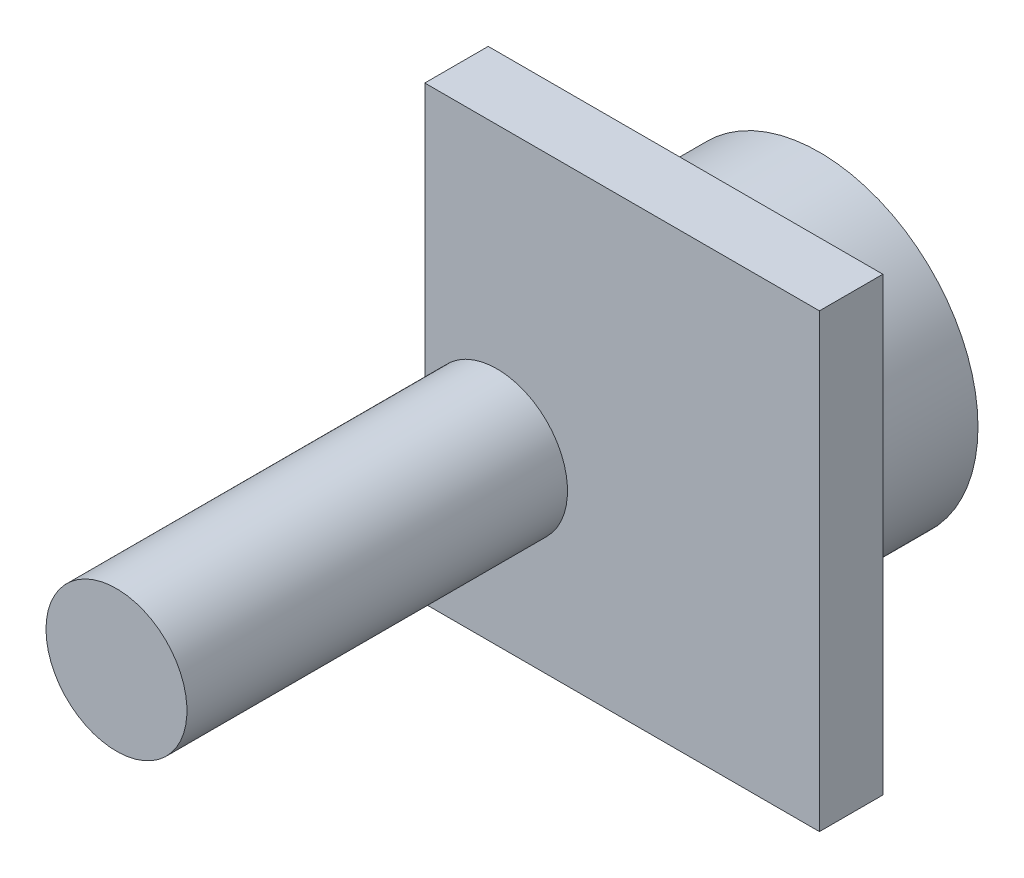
from build123d import *

# Parameters (mm, degrees)
SKETCH_1_R          = 4.5
EXTRUDE_1_DEPTH     = 4
SKETCH_2_W          = 11.2
SKETCH_2_H          = 13.8
EXTRUDE_2_DEPTH     = 1.8
SKETCH_3_R          = 3
CUT_EXTRUDE_1_DEPTH = 1
SKETCH_5_R          = 3
BLACK_DEPTH         = 1
SKETCH_4_R          = 2
EXTRUDE_5_DEPTH     = 10.8
SKETCH_6_W          = 11.2
SKETCH_6_H          = 1
CUT_EXTRUDE_2_DEPTH = 2


with BuildPart() as part:
    # Sketch 1 → Extrude 1 (new body)
    with BuildSketch(Plane.XY):
        Circle(SKETCH_1_R)
    extrude(amount=EXTRUDE_1_DEPTH)

    # Sketch 2 → Extrude 2 (add)
    with BuildSketch(Plane.XY.offset(4)):
        with Locations((0.2, 0.5)):
            Rectangle(SKETCH_2_W, SKETCH_2_H)
    extrude(amount=EXTRUDE_2_DEPTH)

    # Sketch 3 → Cut-Extrude 1 (cut)
    with BuildSketch(Plane(origin=(0, 0, 0), x_dir=(-1, 0, 0), z_dir=(0, 0, -1))):
        Circle(SKETCH_3_R)
    extrude(amount=-CUT_EXTRUDE_1_DEPTH, mode=Mode.SUBTRACT)

    # Sketch 4 → Extrude 5 (add)
    with BuildSketch(Plane.XY.offset(5.8)):
        with Locations(Location((-3.35, -1.6, 0), (0, 0, 180))):
            Circle(SKETCH_4_R)
    extrude(amount=EXTRUDE_5_DEPTH)

    # Sketch 6 → Cut-Extrude 2 (cut)
    with BuildSketch(Plane.XY.offset(5.8)):
        with Locations((0.2, 6.9)):
            Rectangle(SKETCH_6_W, SKETCH_6_H)
    extrude(amount=-CUT_EXTRUDE_2_DEPTH, mode=Mode.SUBTRACT)


with BuildPart() as body_2:
    # Sketch 5 → black (new body)
    with BuildSketch(Plane(origin=(0, 0, 1), x_dir=(-1, 0, 0), z_dir=(0, 0, -1))):
        Circle(SKETCH_5_R)
    extrude(amount=BLACK_DEPTH)


solid = Compound([part.part, body_2.part])
